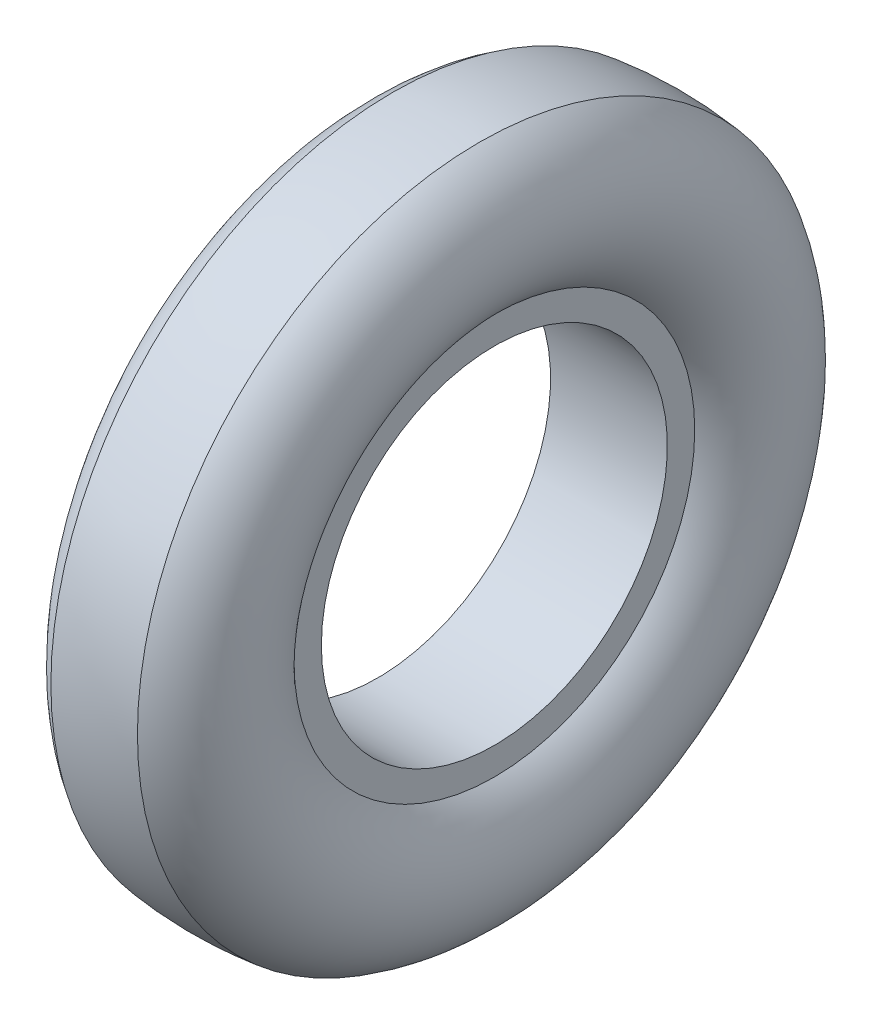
from build123d import *


with BuildPart() as part:
    # Esquisse1 → Base-R_volution (revolve)
    with BuildSketch(Plane.XY, mode=Mode.PRIVATE) as base_r_volution_sk:
        Polygon((-40, 118.5), (40, 118.5), (40, 138.5), (33, 138.5), (33, 123.5), (-33, 123.5), (-33, 138.5), (-40, 138.5), align=None)
    revolve(base_r_volution_sk.sketch.rotate(Axis((-100, 0, 0), (1, 0, 0)), 90), axis=Axis((-100, 0, 0), (1, 0, 0)))

    # Esquisse2 → Boss.-R_vol.1 (revolve)
    with BuildSketch(Plane.XY, mode=Mode.PRIVATE) as boss_r_vol_1_sk:
        with BuildLine():
            Line((-29.993329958, 130), (29.993329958, 130))
            ThreePointArc((29.993329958, 130), (59.999662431, 182.166640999), (29.644027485, 234.130800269))
            ThreePointArc((29.644027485, 234.130800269), (0, 236), (-29.644027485, 234.130800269))
            ThreePointArc((-29.644027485, 234.130800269), (-59.999662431, 182.166640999), (-29.993329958, 130))
        make_face()
        with BuildLine():
            Line((-35.707142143, 146.965374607), (35.707142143, 146.965374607))
            ThreePointArc((35.707142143, 146.965374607), (0, 231.965374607), (-35.707142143, 146.965374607))
        make_face(mode=Mode.SUBTRACT)
    revolve(boss_r_vol_1_sk.sketch.rotate(Axis((0, 0, 0), (1, 0, 0)), 90), axis=Axis((0, 0, 0), (1, 0, 0)))


solid = part.part
